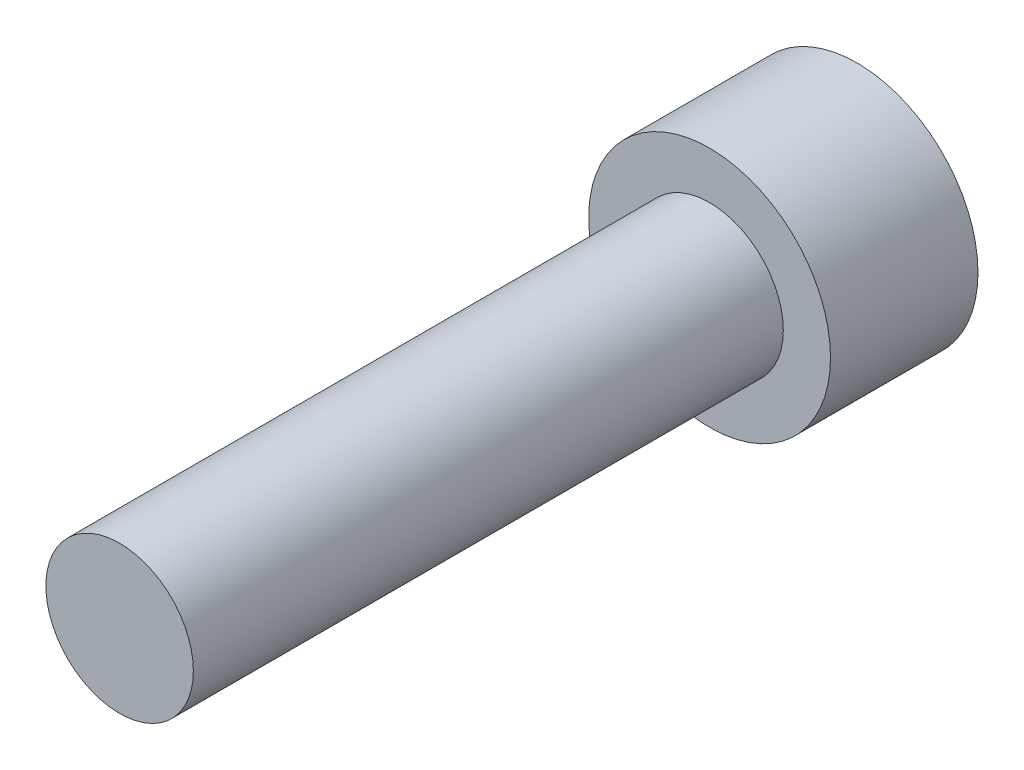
ISO-10303-21;
HEADER;
FILE_DESCRIPTION(('STEP AP214'),'2;1');
FILE_NAME('part.step','',(''),(''),'','','');
FILE_SCHEMA(('AUTOMOTIVE_DESIGN { 1 0 10303 214 1 1 1 1 }'));
ENDSEC;
DATA;
#1=APPLICATION_CONTEXT('core data for automotive mechanical design processes');
#2=APPLICATION_PROTOCOL_DEFINITION('international standard','automotive_design',2000,#1);
#3=PRODUCT_CONTEXT('',#1,'mechanical');
#4=PRODUCT('Part','Part','',(#3));
#5=PRODUCT_RELATED_PRODUCT_CATEGORY('part','',(#4));
#6=PRODUCT_DEFINITION_FORMATION('','',#4);
#7=PRODUCT_DEFINITION_CONTEXT('part definition',#1,'design');
#8=PRODUCT_DEFINITION('design','',#6,#7);
#9=PRODUCT_DEFINITION_SHAPE('','',#8);
#10=(LENGTH_UNIT() NAMED_UNIT(*) SI_UNIT(.MILLI.,.METRE.));
#11=(NAMED_UNIT(*) PLANE_ANGLE_UNIT() SI_UNIT($,.RADIAN.));
#12=(NAMED_UNIT(*) SI_UNIT($,.STERADIAN.) SOLID_ANGLE_UNIT());
#13=UNCERTAINTY_MEASURE_WITH_UNIT(LENGTH_MEASURE(1.E-05),#10,'distance_accuracy_value','');
#14=(GEOMETRIC_REPRESENTATION_CONTEXT(3) GLOBAL_UNCERTAINTY_ASSIGNED_CONTEXT((#13)) GLOBAL_UNIT_ASSIGNED_CONTEXT((#10,
#11,#12)) REPRESENTATION_CONTEXT('',''));
#15=CARTESIAN_POINT('',(0.,0.,0.));
#16=DIRECTION('',(0.,0.,1.));
#17=DIRECTION('',(1.,0.,0.));
#18=AXIS2_PLACEMENT_3D('',#15,#16,#17);
#19=CARTESIAN_POINT('',(0.,0.,12.7));
#20=DIRECTION('',(0.,0.,1.));
#21=DIRECTION('',(1.,0.,0.));
#22=AXIS2_PLACEMENT_3D('',#19,#20,#21);
#23=PLANE('',#22);
#24=CARTESIAN_POINT('',(0.,0.,12.7));
#25=DIRECTION('',(0.,0.,1.));
#26=DIRECTION('',(1.,0.,0.));
#27=AXIS2_PLACEMENT_3D('',#24,#25,#26);
#28=CIRCLE('',#27,1.5875);
#29=CARTESIAN_POINT('',(1.5875,0.,12.7));
#30=VERTEX_POINT('',#29);
#31=EDGE_CURVE('E11',#30,#30,#28,.T.);
#32=ORIENTED_EDGE('',*,*,#31,.T.);
#33=EDGE_LOOP('',(#32));
#34=FACE_BOUND('',#33,.T.);
#35=ADVANCED_FACE('F37',(#34),#23,.T.);
#36=CARTESIAN_POINT('',(0.,0.,12.7));
#37=DIRECTION('',(0.,0.,1.));
#38=DIRECTION('',(1.,0.,0.));
#39=AXIS2_PLACEMENT_3D('',#36,#37,#38);
#40=CYLINDRICAL_SURFACE('',#39,1.5875);
#41=CARTESIAN_POINT('',(0.,0.,0.));
#42=DIRECTION('',(0.,0.,1.));
#43=DIRECTION('',(1.,0.,0.));
#44=AXIS2_PLACEMENT_3D('',#41,#42,#43);
#45=CIRCLE('',#44,1.5875);
#46=CARTESIAN_POINT('',(1.5875,0.,0.));
#47=VERTEX_POINT('',#46);
#48=EDGE_CURVE('E44',#47,#47,#45,.T.);
#49=ORIENTED_EDGE('',*,*,#48,.T.);
#50=EDGE_LOOP('',(#49));
#51=FACE_BOUND('',#50,.T.);
#52=ORIENTED_EDGE('',*,*,#31,.F.);
#53=EDGE_LOOP('',(#52));
#54=FACE_BOUND('',#53,.T.);
#55=ADVANCED_FACE('F151',(#51,#54),#40,.T.);
#56=CARTESIAN_POINT('',(0.,-1.5875,0.));
#57=DIRECTION('',(0.,0.,1.));
#58=DIRECTION('',(1.,0.,0.));
#59=AXIS2_PLACEMENT_3D('',#56,#57,#58);
#60=PLANE('',#59);
#61=CARTESIAN_POINT('',(0.,0.,0.));
#62=DIRECTION('',(0.,0.,1.));
#63=DIRECTION('',(1.,0.,0.));
#64=AXIS2_PLACEMENT_3D('',#61,#62,#63);
#65=CIRCLE('',#64,2.6035);
#66=CARTESIAN_POINT('',(2.6035,0.,0.));
#67=VERTEX_POINT('',#66);
#68=EDGE_CURVE('E146',#67,#67,#65,.T.);
#69=ORIENTED_EDGE('',*,*,#68,.T.);
#70=EDGE_LOOP('',(#69));
#71=FACE_BOUND('',#70,.T.);
#72=ORIENTED_EDGE('',*,*,#48,.F.);
#73=EDGE_LOOP('',(#72));
#74=FACE_BOUND('',#73,.T.);
#75=ADVANCED_FACE('F154',(#71,#74),#60,.T.);
#76=CARTESIAN_POINT('',(0.,0.,12.7));
#77=DIRECTION('',(0.,0.,1.));
#78=DIRECTION('',(1.,0.,0.));
#79=AXIS2_PLACEMENT_3D('',#76,#77,#78);
#80=CYLINDRICAL_SURFACE('',#79,2.6035);
#81=CARTESIAN_POINT('',(0.,0.,-3.175));
#82=DIRECTION('',(0.,0.,1.));
#83=DIRECTION('',(1.,0.,0.));
#84=AXIS2_PLACEMENT_3D('',#81,#82,#83);
#85=CIRCLE('',#84,2.6035);
#86=CARTESIAN_POINT('',(2.6035,0.,-3.175));
#87=VERTEX_POINT('',#86);
#88=EDGE_CURVE('E138',#87,#87,#85,.T.);
#89=ORIENTED_EDGE('',*,*,#88,.T.);
#90=EDGE_LOOP('',(#89));
#91=FACE_BOUND('',#90,.T.);
#92=ORIENTED_EDGE('',*,*,#68,.F.);
#93=EDGE_LOOP('',(#92));
#94=FACE_BOUND('',#93,.T.);
#95=ADVANCED_FACE('F156',(#91,#94),#80,.T.);
#96=CARTESIAN_POINT('',(0.,-2.6035,-3.175));
#97=DIRECTION('',(0.,0.,-1.));
#98=DIRECTION('',(-1.,0.,0.));
#99=AXIS2_PLACEMENT_3D('',#96,#97,#98);
#100=PLANE('',#99);
#101=DIRECTION('',(0.866025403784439,-0.5,0.));
#102=VECTOR('',#101,1.);
#103=CARTESIAN_POINT('',(0.,1.36381680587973,-3.175));
#104=LINE('',#103,#102);
#105=CARTESIAN_POINT('',(0.,1.36381680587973,-3.175));
#106=VERTEX_POINT('',#105);
#107=CARTESIAN_POINT('',(1.1811,0.681908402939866,-3.175));
#108=VERTEX_POINT('',#107);
#109=EDGE_CURVE('E51',#106,#108,#104,.T.);
#110=ORIENTED_EDGE('',*,*,#109,.F.);
#111=DIRECTION('',(0.866025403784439,0.5,0.));
#112=VECTOR('',#111,1.);
#113=CARTESIAN_POINT('',(-1.1811,0.681908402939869,-3.175));
#114=LINE('',#113,#112);
#115=CARTESIAN_POINT('',(-1.1811,0.681908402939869,-3.175));
#116=VERTEX_POINT('',#115);
#117=EDGE_CURVE('E134',#116,#106,#114,.T.);
#118=ORIENTED_EDGE('',*,*,#117,.F.);
#119=DIRECTION('',(0.,1.,0.));
#120=VECTOR('',#119,1.);
#121=CARTESIAN_POINT('',(-1.1811,-0.681908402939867,-3.175));
#122=LINE('',#121,#120);
#123=CARTESIAN_POINT('',(-1.1811,-0.681908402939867,-3.175));
#124=VERTEX_POINT('',#123);
#125=EDGE_CURVE('E132',#124,#116,#122,.T.);
#126=ORIENTED_EDGE('',*,*,#125,.F.);
#127=DIRECTION('',(-0.866025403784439,0.5,0.));
#128=VECTOR('',#127,1.);
#129=CARTESIAN_POINT('',(0.,-1.36381680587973,-3.175));
#130=LINE('',#129,#128);
#131=CARTESIAN_POINT('',(0.,-1.36381680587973,-3.175));
#132=VERTEX_POINT('',#131);
#133=EDGE_CURVE('E99',#132,#124,#130,.T.);
#134=ORIENTED_EDGE('',*,*,#133,.F.);
#135=DIRECTION('',(-0.866025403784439,-0.5,0.));
#136=VECTOR('',#135,1.);
#137=CARTESIAN_POINT('',(1.1811,-0.681908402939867,-3.175));
#138=LINE('',#137,#136);
#139=CARTESIAN_POINT('',(1.1811,-0.681908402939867,-3.175));
#140=VERTEX_POINT('',#139);
#141=EDGE_CURVE('E128',#140,#132,#138,.T.);
#142=ORIENTED_EDGE('',*,*,#141,.F.);
#143=DIRECTION('',(0.,-1.,0.));
#144=VECTOR('',#143,1.);
#145=CARTESIAN_POINT('',(1.1811,0.681908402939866,-3.175));
#146=LINE('',#145,#144);
#147=EDGE_CURVE('E125',#108,#140,#146,.T.);
#148=ORIENTED_EDGE('',*,*,#147,.F.);
#149=EDGE_LOOP('',(#110,#118,#126,#134,#142,#148));
#150=FACE_BOUND('',#149,.T.);
#151=ORIENTED_EDGE('',*,*,#88,.F.);
#152=EDGE_LOOP('',(#151));
#153=FACE_BOUND('',#152,.T.);
#154=ADVANCED_FACE('F163',(#150,#153),#100,.T.);
#155=CARTESIAN_POINT('',(0.,1.36381680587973,-1.397));
#156=DIRECTION('',(0.5,0.866025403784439,0.));
#157=DIRECTION('',(-0.866025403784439,0.5,0.));
#158=AXIS2_PLACEMENT_3D('',#155,#156,#157);
#159=PLANE('',#158);
#160=ORIENTED_EDGE('',*,*,#109,.T.);
#161=DIRECTION('',(0.,0.,-1.));
#162=VECTOR('',#161,1.);
#163=CARTESIAN_POINT('',(1.1811,0.681908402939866,-1.397));
#164=LINE('',#163,#162);
#165=CARTESIAN_POINT('',(1.1811,0.681908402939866,-1.397));
#166=VERTEX_POINT('',#165);
#167=EDGE_CURVE('E81',#166,#108,#164,.T.);
#168=ORIENTED_EDGE('',*,*,#167,.F.);
#169=DIRECTION('',(0.866025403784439,-0.5,0.));
#170=VECTOR('',#169,1.);
#171=CARTESIAN_POINT('',(0.,1.36381680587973,-1.397));
#172=LINE('',#171,#170);
#173=CARTESIAN_POINT('',(0.,1.36381680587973,-1.397));
#174=VERTEX_POINT('',#173);
#175=EDGE_CURVE('E136',#174,#166,#172,.T.);
#176=ORIENTED_EDGE('',*,*,#175,.F.);
#177=DIRECTION('',(0.,0.,-1.));
#178=VECTOR('',#177,1.);
#179=CARTESIAN_POINT('',(0.,1.36381680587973,-1.397));
#180=LINE('',#179,#178);
#181=EDGE_CURVE('E59',#174,#106,#180,.T.);
#182=ORIENTED_EDGE('',*,*,#181,.T.);
#183=EDGE_LOOP('',(#160,#168,#176,#182));
#184=FACE_BOUND('',#183,.T.);
#185=ADVANCED_FACE('F197',(#184),#159,.F.);
#186=CARTESIAN_POINT('',(-1.1811,0.681908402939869,-1.397));
#187=DIRECTION('',(-0.5,0.866025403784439,0.));
#188=DIRECTION('',(-0.866025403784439,-0.5,0.));
#189=AXIS2_PLACEMENT_3D('',#186,#187,#188);
#190=PLANE('',#189);
#191=ORIENTED_EDGE('',*,*,#117,.T.);
#192=ORIENTED_EDGE('',*,*,#181,.F.);
#193=DIRECTION('',(0.866025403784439,0.5,0.));
#194=VECTOR('',#193,1.);
#195=CARTESIAN_POINT('',(-1.1811,0.681908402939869,-1.397));
#196=LINE('',#195,#194);
#197=CARTESIAN_POINT('',(-1.1811,0.681908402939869,-1.397));
#198=VERTEX_POINT('',#197);
#199=EDGE_CURVE('E111',#198,#174,#196,.T.);
#200=ORIENTED_EDGE('',*,*,#199,.F.);
#201=DIRECTION('',(0.,0.,-1.));
#202=VECTOR('',#201,1.);
#203=CARTESIAN_POINT('',(-1.1811,0.681908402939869,-1.397));
#204=LINE('',#203,#202);
#205=EDGE_CURVE('E103',#198,#116,#204,.T.);
#206=ORIENTED_EDGE('',*,*,#205,.T.);
#207=EDGE_LOOP('',(#191,#192,#200,#206));
#208=FACE_BOUND('',#207,.T.);
#209=ADVANCED_FACE('F208',(#208),#190,.F.);
#210=CARTESIAN_POINT('',(-1.1811,-0.681908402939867,-1.397));
#211=DIRECTION('',(-1.,0.,0.));
#212=DIRECTION('',(0.,0.,1.));
#213=AXIS2_PLACEMENT_3D('',#210,#211,#212);
#214=PLANE('',#213);
#215=ORIENTED_EDGE('',*,*,#125,.T.);
#216=ORIENTED_EDGE('',*,*,#205,.F.);
#217=DIRECTION('',(0.,1.,0.));
#218=VECTOR('',#217,1.);
#219=CARTESIAN_POINT('',(-1.1811,-0.681908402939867,-1.397));
#220=LINE('',#219,#218);
#221=CARTESIAN_POINT('',(-1.1811,-0.681908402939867,-1.397));
#222=VERTEX_POINT('',#221);
#223=EDGE_CURVE('E107',#222,#198,#220,.T.);
#224=ORIENTED_EDGE('',*,*,#223,.F.);
#225=DIRECTION('',(0.,0.,-1.));
#226=VECTOR('',#225,1.);
#227=CARTESIAN_POINT('',(-1.1811,-0.681908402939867,-1.397));
#228=LINE('',#227,#226);
#229=EDGE_CURVE('E92',#222,#124,#228,.T.);
#230=ORIENTED_EDGE('',*,*,#229,.T.);
#231=EDGE_LOOP('',(#215,#216,#224,#230));
#232=FACE_BOUND('',#231,.T.);
#233=ADVANCED_FACE('F108',(#232),#214,.F.);
#234=CARTESIAN_POINT('',(0.,-1.36381680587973,-1.397));
#235=DIRECTION('',(-0.5,-0.866025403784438,0.));
#236=DIRECTION('',(0.866025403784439,-0.5,0.));
#237=AXIS2_PLACEMENT_3D('',#234,#235,#236);
#238=PLANE('',#237);
#239=ORIENTED_EDGE('',*,*,#133,.T.);
#240=ORIENTED_EDGE('',*,*,#229,.F.);
#241=DIRECTION('',(-0.866025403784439,0.5,0.));
#242=VECTOR('',#241,1.);
#243=CARTESIAN_POINT('',(0.,-1.36381680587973,-1.397));
#244=LINE('',#243,#242);
#245=CARTESIAN_POINT('',(0.,-1.36381680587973,-1.397));
#246=VERTEX_POINT('',#245);
#247=EDGE_CURVE('E96',#246,#222,#244,.T.);
#248=ORIENTED_EDGE('',*,*,#247,.F.);
#249=DIRECTION('',(0.,0.,-1.));
#250=VECTOR('',#249,1.);
#251=CARTESIAN_POINT('',(0.,-1.36381680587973,-1.397));
#252=LINE('',#251,#250);
#253=EDGE_CURVE('E104',#246,#132,#252,.T.);
#254=ORIENTED_EDGE('',*,*,#253,.T.);
#255=EDGE_LOOP('',(#239,#240,#248,#254));
#256=FACE_BOUND('',#255,.T.);
#257=ADVANCED_FACE('F94',(#256),#238,.F.);
#258=CARTESIAN_POINT('',(1.1811,-0.681908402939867,-1.397));
#259=DIRECTION('',(0.5,-0.866025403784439,0.));
#260=DIRECTION('',(0.866025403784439,0.5,0.));
#261=AXIS2_PLACEMENT_3D('',#258,#259,#260);
#262=PLANE('',#261);
#263=ORIENTED_EDGE('',*,*,#141,.T.);
#264=ORIENTED_EDGE('',*,*,#253,.F.);
#265=DIRECTION('',(-0.866025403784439,-0.5,0.));
#266=VECTOR('',#265,1.);
#267=CARTESIAN_POINT('',(1.1811,-0.681908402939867,-1.397));
#268=LINE('',#267,#266);
#269=CARTESIAN_POINT('',(1.1811,-0.681908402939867,-1.397));
#270=VERTEX_POINT('',#269);
#271=EDGE_CURVE('E117',#270,#246,#268,.T.);
#272=ORIENTED_EDGE('',*,*,#271,.F.);
#273=DIRECTION('',(0.,0.,-1.));
#274=VECTOR('',#273,1.);
#275=CARTESIAN_POINT('',(1.1811,-0.681908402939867,-1.397));
#276=LINE('',#275,#274);
#277=EDGE_CURVE('E141',#270,#140,#276,.T.);
#278=ORIENTED_EDGE('',*,*,#277,.T.);
#279=EDGE_LOOP('',(#263,#264,#272,#278));
#280=FACE_BOUND('',#279,.T.);
#281=ADVANCED_FACE('F236',(#280),#262,.F.);
#282=CARTESIAN_POINT('',(1.1811,0.681908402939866,-1.397));
#283=DIRECTION('',(1.,0.,0.));
#284=DIRECTION('',(0.,1.,0.));
#285=AXIS2_PLACEMENT_3D('',#282,#283,#284);
#286=PLANE('',#285);
#287=ORIENTED_EDGE('',*,*,#147,.T.);
#288=ORIENTED_EDGE('',*,*,#277,.F.);
#289=DIRECTION('',(0.,-1.,0.));
#290=VECTOR('',#289,1.);
#291=CARTESIAN_POINT('',(1.1811,0.681908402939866,-1.397));
#292=LINE('',#291,#290);
#293=EDGE_CURVE('E119',#166,#270,#292,.T.);
#294=ORIENTED_EDGE('',*,*,#293,.F.);
#295=ORIENTED_EDGE('',*,*,#167,.T.);
#296=EDGE_LOOP('',(#287,#288,#294,#295));
#297=FACE_BOUND('',#296,.T.);
#298=ADVANCED_FACE('F246',(#297),#286,.F.);
#299=CARTESIAN_POINT('',(1.1811,0.681908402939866,-1.397));
#300=DIRECTION('',(0.,0.,-1.));
#301=DIRECTION('',(-1.,0.,0.));
#302=AXIS2_PLACEMENT_3D('',#299,#300,#301);
#303=PLANE('',#302);
#304=ORIENTED_EDGE('',*,*,#175,.T.);
#305=ORIENTED_EDGE('',*,*,#293,.T.);
#306=ORIENTED_EDGE('',*,*,#271,.T.);
#307=ORIENTED_EDGE('',*,*,#247,.T.);
#308=ORIENTED_EDGE('',*,*,#223,.T.);
#309=ORIENTED_EDGE('',*,*,#199,.T.);
#310=EDGE_LOOP('',(#304,#305,#306,#307,#308,#309));
#311=FACE_BOUND('',#310,.T.);
#312=ADVANCED_FACE('F114',(#311),#303,.T.);
#313=CLOSED_SHELL('',(#35,#55,#75,#95,#154,#185,#209,#233,#257,#281,#298,#312));
#314=MANIFOLD_SOLID_BREP('B2',#313);
#315=ADVANCED_BREP_SHAPE_REPRESENTATION('',(#18,#314),#14);
#316=SHAPE_DEFINITION_REPRESENTATION(#9,#315);
ENDSEC;
END-ISO-10303-21;
